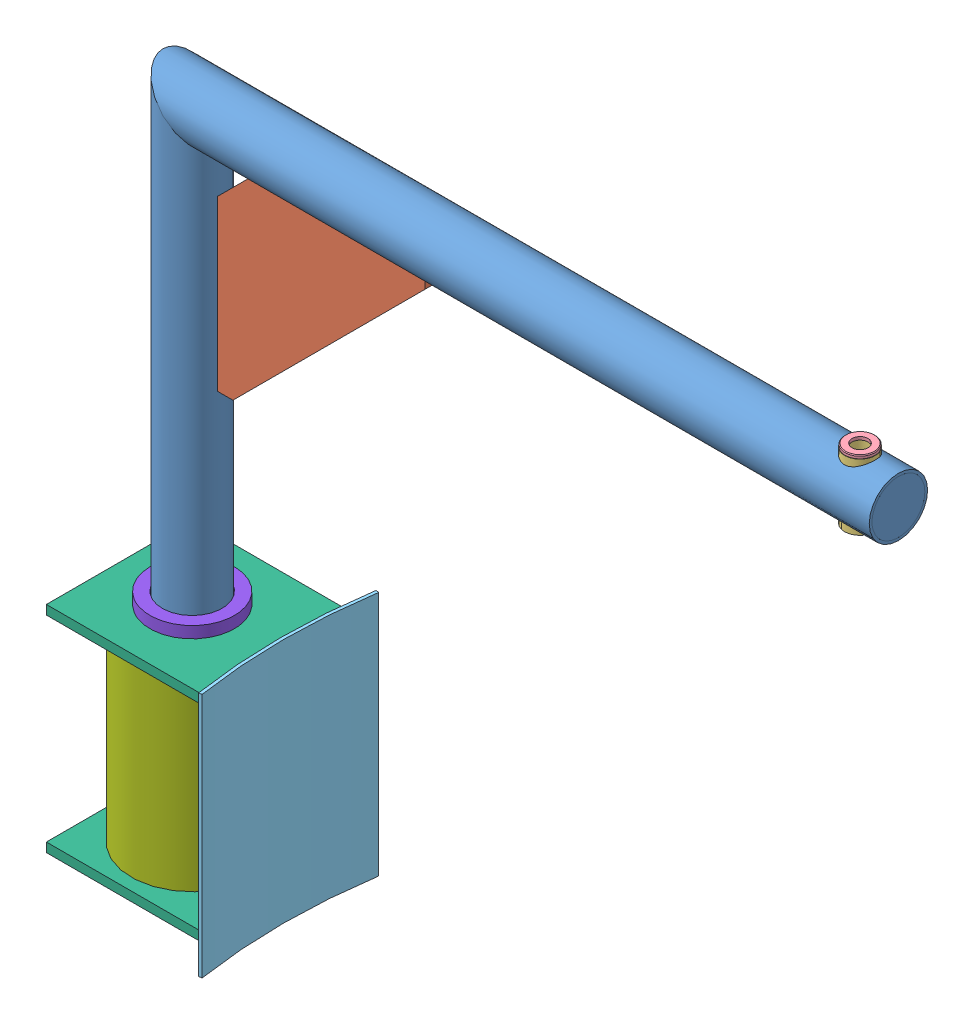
SolidWorks assembly Davit.SLDASM, configuration Standard (file format 4400). Lengths in mm.
Overall size (1016.73 941.95 231.23).
10 component instances, 8 part files, 10 mates.
Components (placement in the parent):
- Galgen-1: Galgen.SLDPRT [Standard<Wie bearbeitet>] at origin size (958 933 76.1)
- Rippe_Galgen-1: Rippe_Galgen.SLDPRT [Standard] at (38.05 586.9 -5) size (270 270 10)
- Huelse_Galgen_R40_26_86-1: Huelse_Galgen_R40_26_86.SLDPRT [Standard] at (869.95 851.95 0) x (0.994381 0 0.105863) z (-0.105863 0 0.994381) size (40 86 40)
- Scheibe_21-1: Scheibe_21.SLDPRT [Standard] at (869.95 937.95 0) size (39 4 39)
- Galgenaufnahme-1: Galgenaufnahme.SLDASM [Standard] at (868.9913 25 0) size (224.64 320 231.23)
  - Futterblech_320x230-1: Futterblech_320x230.SLDPRT [Standard] at origin size (12.87 320 231.23)
  - Fuehrung_216x190-1: Fuehrung_216x190.SLDPRT [Standard] at (-963.9913 288 95) size (216 12 190)
  - Fuehrung_216x190-2: Fuehrung_216x190.SLDPRT [Standard] at (-963.9913 20 95) size (216 12 190)
  - Rohr_159x5-1: Rohr_159x5.SLDPRT [Standard] at (-868.9913 32 0) x (0.248863 0 0.968539) z (-0.968539 0 0.248863) size (159 256 159)
  - Ring_100_78-1: Ring_100_78.SLDPRT [Standard] at (-868.9913 300 0) x (0.902645 0 0.430386) z (-0.430386 0 0.902645) size (110 15 110)
Mates (geometry in assembly coordinates):
- Abstand1: distance = 5 mm aligned: plane of assembly through (0 0 0) normal (0 0 1); plane of Rippe_Galgen-1 through (38.05 586.9 -5) normal (0 0 1)
- Tangential1: tangent anti-aligned: cylinder of Galgen-1 through (919.95 894.95 0) axis (-1 0 0) radius 38.05; plane of Rippe_Galgen-1 through (88.05 856.9 5) normal (0 1 0)
- Tangential2: tangent anti-aligned: cylinder of Galgen-1 through (0 894.95 0) axis (0 -1 0) radius 38.05; plane of Rippe_Galgen-1 through (38.05 806.9 5) normal (-1 0 0)
- Konzentrisch1: concentric anti-aligned: cylinder of Galgen-1 through (869.95 853 0) axis (0 1 0) radius 20; cylinder of Huelse_Galgen_R40_26_86-1 through (869.95 937.95 0) axis (0 -1 0) radius 20
- Abstand2: distance = 43 mm: plane of Huelse_Galgen_R40_26_86-1 through (869.95 937.95 0) normal (0 1 0); line of Galgen-1 through (0 894.95 0) axis (1 0 0)
- Konzentrisch3: concentric aligned: cylinder of Huelse_Galgen_R40_26_86-1 through (869.95 937.95 0) axis (0 -1 0) radius 20; cylinder of Scheibe_21-1 through (869.95 941.95 0) axis (0 -1 0) radius 19.5
- Deckungsgleich3: coincident anti-aligned: plane of Huelse_Galgen_R40_26_86-1 through (869.95 937.95 0) normal (0 1 0); plane of Scheibe_21-1 through (869.95 937.95 0) normal (0 -1 0)
- Konzentrisch9: concentric aligned: cylinder of Galgen-1 through (0 894.95 0) axis (0 -1 0) radius 38.05; cylinder of Galgenaufnahme-1/Fuehrung_216x190-1 through (0 325 0) axis (0 -1 0) radius 38.25
- Parallel3: parallel aligned: plane of Galgenaufnahme-1/Fuehrung_216x190-1 through (-95 325 95) normal (0 0 1); plane of assembly through (0 0 0) normal (0 0 1)
- Abstand7: distance = 325 mm anti-aligned: plane of Galgen-1 through (0 0 0) normal (0 -1 0); plane of Galgenaufnahme-1/Fuehrung_216x190-1 through (868.9913 325 0) normal (0 1 0)
